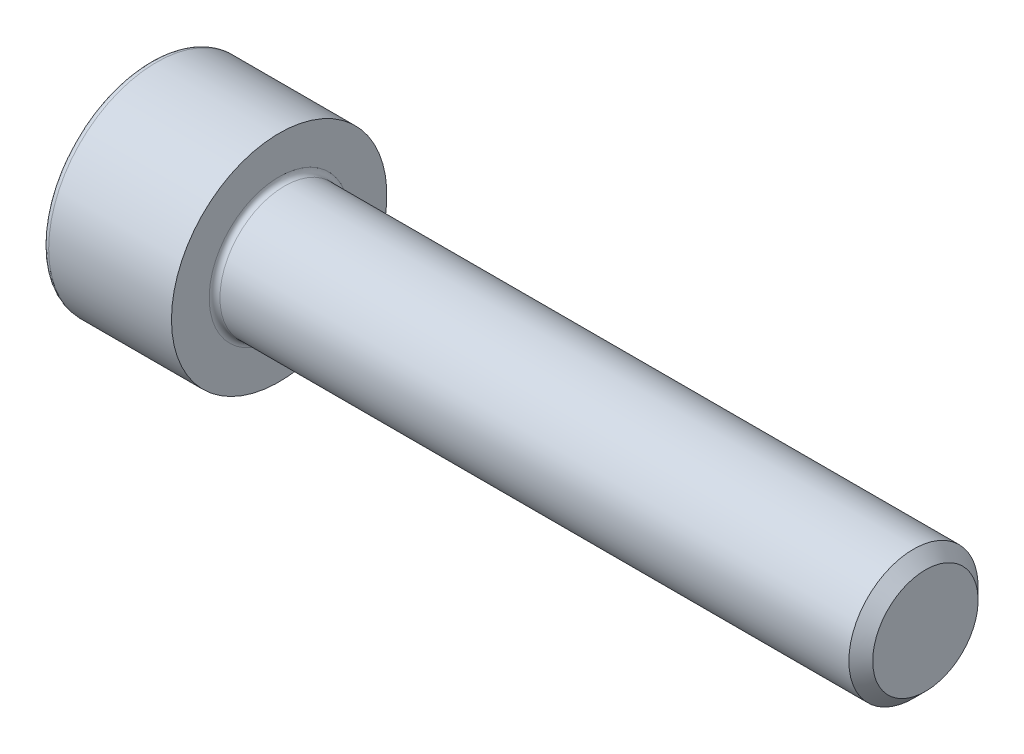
ISO-10303-21;
HEADER;
FILE_DESCRIPTION(('STEP AP214'),'2;1');
FILE_NAME('part.step','',(''),(''),'','','');
FILE_SCHEMA(('AUTOMOTIVE_DESIGN { 1 0 10303 214 1 1 1 1 }'));
ENDSEC;
DATA;
#1=APPLICATION_CONTEXT('core data for automotive mechanical design processes');
#2=APPLICATION_PROTOCOL_DEFINITION('international standard','automotive_design',2000,#1);
#3=PRODUCT_CONTEXT('',#1,'mechanical');
#4=PRODUCT('Part','Part','',(#3));
#5=PRODUCT_RELATED_PRODUCT_CATEGORY('part','',(#4));
#6=PRODUCT_DEFINITION_FORMATION('','',#4);
#7=PRODUCT_DEFINITION_CONTEXT('part definition',#1,'design');
#8=PRODUCT_DEFINITION('design','',#6,#7);
#9=PRODUCT_DEFINITION_SHAPE('','',#8);
#10=(LENGTH_UNIT() NAMED_UNIT(*) SI_UNIT(.MILLI.,.METRE.));
#11=(NAMED_UNIT(*) PLANE_ANGLE_UNIT() SI_UNIT($,.RADIAN.));
#12=(NAMED_UNIT(*) SI_UNIT($,.STERADIAN.) SOLID_ANGLE_UNIT());
#13=UNCERTAINTY_MEASURE_WITH_UNIT(LENGTH_MEASURE(1.E-05),#10,'distance_accuracy_value','');
#14=(GEOMETRIC_REPRESENTATION_CONTEXT(3) GLOBAL_UNCERTAINTY_ASSIGNED_CONTEXT((#13)) GLOBAL_UNIT_ASSIGNED_CONTEXT((#10,
#11,#12)) REPRESENTATION_CONTEXT('',''));
#15=CARTESIAN_POINT('',(0.,0.,0.));
#16=DIRECTION('',(0.,0.,1.));
#17=DIRECTION('',(1.,0.,0.));
#18=AXIS2_PLACEMENT_3D('',#15,#16,#17);
#19=CARTESIAN_POINT('',(0.,0.,0.));
#20=DIRECTION('',(-1.,0.,0.));
#21=DIRECTION('',(0.,0.,1.));
#22=AXIS2_PLACEMENT_3D('',#19,#20,#21);
#23=PLANE('',#22);
#24=DIRECTION('',(0.,-0.499999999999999,0.866025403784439));
#25=VECTOR('',#24,1.);
#26=CARTESIAN_POINT('',(0.,2.93524876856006,0.));
#27=LINE('',#26,#25);
#28=CARTESIAN_POINT('',(0.,2.93524876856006,0.));
#29=VERTEX_POINT('',#28);
#30=CARTESIAN_POINT('',(0.,1.46762438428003,2.542));
#31=VERTEX_POINT('',#30);
#32=EDGE_CURVE('E254',#29,#31,#27,.T.);
#33=ORIENTED_EDGE('',*,*,#32,.T.);
#34=DIRECTION('',(0.,1.,0.));
#35=VECTOR('',#34,1.);
#36=CARTESIAN_POINT('',(0.,-1.46762438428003,2.542));
#37=LINE('',#36,#35);
#38=CARTESIAN_POINT('',(0.,-1.46762438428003,2.542));
#39=VERTEX_POINT('',#38);
#40=EDGE_CURVE('E126',#39,#31,#37,.T.);
#41=ORIENTED_EDGE('',*,*,#40,.F.);
#42=DIRECTION('',(0.,-0.500000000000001,-0.866025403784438));
#43=VECTOR('',#42,1.);
#44=CARTESIAN_POINT('',(0.,-1.46762438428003,2.542));
#45=LINE('',#44,#43);
#46=CARTESIAN_POINT('',(0.,-2.93524876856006,0.));
#47=VERTEX_POINT('',#46);
#48=EDGE_CURVE('E257',#39,#47,#45,.T.);
#49=ORIENTED_EDGE('',*,*,#48,.T.);
#50=DIRECTION('',(0.,0.499999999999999,-0.866025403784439));
#51=VECTOR('',#50,1.);
#52=CARTESIAN_POINT('',(0.,-2.93524876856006,0.));
#53=LINE('',#52,#51);
#54=CARTESIAN_POINT('',(0.,-1.46762438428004,-2.542));
#55=VERTEX_POINT('',#54);
#56=EDGE_CURVE('E260',#47,#55,#53,.T.);
#57=ORIENTED_EDGE('',*,*,#56,.T.);
#58=DIRECTION('',(0.,-1.,0.));
#59=VECTOR('',#58,1.);
#60=CARTESIAN_POINT('',(0.,1.46762438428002,-2.54200000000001));
#61=LINE('',#60,#59);
#62=CARTESIAN_POINT('',(0.,1.46762438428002,-2.54200000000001));
#63=VERTEX_POINT('',#62);
#64=EDGE_CURVE('E263',#63,#55,#61,.T.);
#65=ORIENTED_EDGE('',*,*,#64,.F.);
#66=DIRECTION('',(0.,-0.500000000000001,-0.866025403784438));
#67=VECTOR('',#66,1.);
#68=CARTESIAN_POINT('',(0.,2.93524876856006,0.));
#69=LINE('',#68,#67);
#70=EDGE_CURVE('E121',#29,#63,#69,.T.);
#71=ORIENTED_EDGE('',*,*,#70,.F.);
#72=EDGE_LOOP('',(#33,#41,#49,#57,#65,#71));
#73=FACE_BOUND('',#72,.T.);
#74=CARTESIAN_POINT('',(0.,0.,0.));
#75=DIRECTION('',(-1.,0.,0.));
#76=DIRECTION('',(0.,0.,1.));
#77=AXIS2_PLACEMENT_3D('',#74,#75,#76);
#78=CIRCLE('',#77,4.7);
#79=CARTESIAN_POINT('',(0.,0.,4.7));
#80=VERTEX_POINT('',#79);
#81=EDGE_CURVE('E38',#80,#80,#78,.T.);
#82=ORIENTED_EDGE('',*,*,#81,.T.);
#83=EDGE_LOOP('',(#82));
#84=FACE_BOUND('',#83,.T.);
#85=ADVANCED_FACE('F30',(#73,#84),#23,.T.);
#86=CARTESIAN_POINT('',(-31.75,0.,0.));
#87=DIRECTION('',(-1.,0.,0.));
#88=DIRECTION('',(0.,0.,1.));
#89=AXIS2_PLACEMENT_3D('',#86,#87,#88);
#90=CYLINDRICAL_SURFACE('',#89,5.);
#91=CARTESIAN_POINT('',(0.300000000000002,0.,0.));
#92=DIRECTION('',(-1.,0.,0.));
#93=DIRECTION('',(0.,0.,1.));
#94=AXIS2_PLACEMENT_3D('',#91,#92,#93);
#95=CIRCLE('',#94,5.);
#96=CARTESIAN_POINT('',(0.300000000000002,0.,5.));
#97=VERTEX_POINT('',#96);
#98=EDGE_CURVE('E11',#97,#97,#95,.F.);
#99=ORIENTED_EDGE('',*,*,#98,.T.);
#100=EDGE_LOOP('',(#99));
#101=FACE_BOUND('',#100,.T.);
#102=CARTESIAN_POINT('',(6.,0.,0.));
#103=DIRECTION('',(-1.,0.,0.));
#104=DIRECTION('',(0.,0.,1.));
#105=AXIS2_PLACEMENT_3D('',#102,#103,#104);
#106=CIRCLE('',#105,5.);
#107=CARTESIAN_POINT('',(6.,0.,5.));
#108=VERTEX_POINT('',#107);
#109=EDGE_CURVE('E144',#108,#108,#106,.T.);
#110=ORIENTED_EDGE('',*,*,#109,.T.);
#111=EDGE_LOOP('',(#110));
#112=FACE_BOUND('',#111,.T.);
#113=ADVANCED_FACE('F168',(#101,#112),#90,.T.);
#114=CARTESIAN_POINT('',(6.,5.,0.));
#115=DIRECTION('',(1.,0.,0.));
#116=DIRECTION('',(0.,0.,-1.));
#117=AXIS2_PLACEMENT_3D('',#114,#115,#116);
#118=PLANE('',#117);
#119=CARTESIAN_POINT('',(6.,0.,0.));
#120=DIRECTION('',(1.,0.,0.));
#121=DIRECTION('',(0.,0.,-1.));
#122=AXIS2_PLACEMENT_3D('',#119,#120,#121);
#123=CIRCLE('',#122,3.25);
#124=CARTESIAN_POINT('',(6.,0.,-3.25));
#125=VERTEX_POINT('',#124);
#126=EDGE_CURVE('E147',#125,#125,#123,.F.);
#127=ORIENTED_EDGE('',*,*,#126,.T.);
#128=EDGE_LOOP('',(#127));
#129=FACE_BOUND('',#128,.T.);
#130=ORIENTED_EDGE('',*,*,#109,.F.);
#131=EDGE_LOOP('',(#130));
#132=FACE_BOUND('',#131,.T.);
#133=ADVANCED_FACE('F174',(#129,#132),#118,.T.);
#134=CARTESIAN_POINT('',(-31.75,0.,0.));
#135=DIRECTION('',(-1.,0.,0.));
#136=DIRECTION('',(0.,0.,1.));
#137=AXIS2_PLACEMENT_3D('',#134,#135,#136);
#138=CYLINDRICAL_SURFACE('',#137,3.);
#139=CARTESIAN_POINT('',(6.25,0.,0.));
#140=DIRECTION('',(1.,0.,0.));
#141=DIRECTION('',(0.,0.,-1.));
#142=AXIS2_PLACEMENT_3D('',#139,#140,#141);
#143=CIRCLE('',#142,3.);
#144=CARTESIAN_POINT('',(6.25,0.,-3.));
#145=VERTEX_POINT('',#144);
#146=EDGE_CURVE('E150',#145,#145,#143,.T.);
#147=ORIENTED_EDGE('',*,*,#146,.T.);
#148=EDGE_LOOP('',(#147));
#149=FACE_BOUND('',#148,.T.);
#150=CARTESIAN_POINT('',(35.4455,0.,0.));
#151=DIRECTION('',(-1.,0.,0.));
#152=DIRECTION('',(0.,0.,1.));
#153=AXIS2_PLACEMENT_3D('',#150,#151,#152);
#154=CIRCLE('',#153,3.);
#155=CARTESIAN_POINT('',(35.4455,0.,3.));
#156=VERTEX_POINT('',#155);
#157=EDGE_CURVE('E141',#156,#156,#154,.T.);
#158=ORIENTED_EDGE('',*,*,#157,.T.);
#159=EDGE_LOOP('',(#158));
#160=FACE_BOUND('',#159,.T.);
#161=ADVANCED_FACE('F180',(#149,#160),#138,.T.);
#162=CARTESIAN_POINT('',(36.,0.,0.));
#163=DIRECTION('',(-1.,0.,0.));
#164=DIRECTION('',(0.,0.,1.));
#165=AXIS2_PLACEMENT_3D('',#162,#163,#164);
#166=CONICAL_SURFACE('',#165,2.4455,0.78539816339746);
#167=ORIENTED_EDGE('',*,*,#157,.F.);
#168=EDGE_LOOP('',(#167));
#169=FACE_BOUND('',#168,.T.);
#170=CARTESIAN_POINT('',(36.,0.,0.));
#171=DIRECTION('',(-1.,0.,0.));
#172=DIRECTION('',(0.,0.,1.));
#173=AXIS2_PLACEMENT_3D('',#170,#171,#172);
#174=CIRCLE('',#173,2.4455);
#175=CARTESIAN_POINT('',(36.,0.,2.4455));
#176=VERTEX_POINT('',#175);
#177=EDGE_CURVE('E137',#176,#176,#174,.T.);
#178=ORIENTED_EDGE('',*,*,#177,.T.);
#179=EDGE_LOOP('',(#178));
#180=FACE_BOUND('',#179,.T.);
#181=ADVANCED_FACE('F184',(#169,#180),#166,.T.);
#182=CARTESIAN_POINT('',(36.,2.4455,0.));
#183=DIRECTION('',(1.,0.,0.));
#184=DIRECTION('',(0.,0.,-1.));
#185=AXIS2_PLACEMENT_3D('',#182,#183,#184);
#186=PLANE('',#185);
#187=ORIENTED_EDGE('',*,*,#177,.F.);
#188=EDGE_LOOP('',(#187));
#189=FACE_BOUND('',#188,.T.);
#190=ADVANCED_FACE('F164',(#189),#186,.T.);
#191=CARTESIAN_POINT('',(6.25,0.,0.));
#192=DIRECTION('',(1.,0.,0.));
#193=DIRECTION('',(0.,0.,-1.));
#194=AXIS2_PLACEMENT_3D('',#191,#192,#193);
#195=TOROIDAL_SURFACE('',#194,3.25,0.25);
#196=ORIENTED_EDGE('',*,*,#146,.F.);
#197=EDGE_LOOP('',(#196));
#198=FACE_BOUND('',#197,.T.);
#199=ORIENTED_EDGE('',*,*,#126,.F.);
#200=EDGE_LOOP('',(#199));
#201=FACE_BOUND('',#200,.T.);
#202=ADVANCED_FACE('F157',(#198,#201),#195,.F.);
#203=CARTESIAN_POINT('',(0.300000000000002,0.,0.));
#204=DIRECTION('',(-1.,0.,0.));
#205=DIRECTION('',(0.,0.,1.));
#206=AXIS2_PLACEMENT_3D('',#203,#204,#205);
#207=TOROIDAL_SURFACE('',#206,4.7,0.3);
#208=ORIENTED_EDGE('',*,*,#98,.F.);
#209=EDGE_LOOP('',(#208));
#210=FACE_BOUND('',#209,.T.);
#211=ORIENTED_EDGE('',*,*,#81,.F.);
#212=EDGE_LOOP('',(#211));
#213=FACE_BOUND('',#212,.T.);
#214=ADVANCED_FACE('F32',(#210,#213),#207,.T.);
#215=CARTESIAN_POINT('',(3.,2.93524876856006,0.));
#216=DIRECTION('',(0.,-0.866025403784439,-0.499999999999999));
#217=DIRECTION('',(0.,0.499999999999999,-0.866025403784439));
#218=AXIS2_PLACEMENT_3D('',#215,#216,#217);
#219=PLANE('',#218);
#220=ORIENTED_EDGE('',*,*,#32,.F.);
#221=DIRECTION('',(-1.,0.,0.));
#222=VECTOR('',#221,1.);
#223=CARTESIAN_POINT('',(3.,2.93524876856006,0.));
#224=LINE('',#223,#222);
#225=CARTESIAN_POINT('',(3.,2.93524876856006,0.));
#226=VERTEX_POINT('',#225);
#227=EDGE_CURVE('E244',#226,#29,#224,.T.);
#228=ORIENTED_EDGE('',*,*,#227,.F.);
#229=DIRECTION('',(0.,-0.499999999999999,0.866025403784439));
#230=VECTOR('',#229,1.);
#231=CARTESIAN_POINT('',(3.,2.93524876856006,0.));
#232=LINE('',#231,#230);
#233=CARTESIAN_POINT('',(3.,2.20143657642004,1.271));
#234=VERTEX_POINT('',#233);
#235=EDGE_CURVE('E113',#226,#234,#232,.T.);
#236=ORIENTED_EDGE('',*,*,#235,.T.);
#237=CARTESIAN_POINT('',(3.,1.46762438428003,2.542));
#238=VERTEX_POINT('',#237);
#239=EDGE_CURVE('E104',#234,#238,#232,.T.);
#240=ORIENTED_EDGE('',*,*,#239,.T.);
#241=DIRECTION('',(-1.,0.,0.));
#242=VECTOR('',#241,1.);
#243=CARTESIAN_POINT('',(3.,1.46762438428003,2.542));
#244=LINE('',#243,#242);
#245=EDGE_CURVE('E118',#238,#31,#244,.T.);
#246=ORIENTED_EDGE('',*,*,#245,.T.);
#247=EDGE_LOOP('',(#220,#228,#236,#240,#246));
#248=FACE_BOUND('',#247,.T.);
#249=ADVANCED_FACE('F117',(#248),#219,.T.);
#250=CARTESIAN_POINT('',(3.,-1.46762438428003,2.542));
#251=DIRECTION('',(0.,0.,1.));
#252=DIRECTION('',(0.,-1.,0.));
#253=AXIS2_PLACEMENT_3D('',#250,#251,#252);
#254=PLANE('',#253);
#255=ORIENTED_EDGE('',*,*,#40,.T.);
#256=ORIENTED_EDGE('',*,*,#245,.F.);
#257=DIRECTION('',(0.,1.,0.));
#258=VECTOR('',#257,1.);
#259=CARTESIAN_POINT('',(3.,-1.46762438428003,2.542));
#260=LINE('',#259,#258);
#261=CARTESIAN_POINT('',(3.,0.,2.542));
#262=VERTEX_POINT('',#261);
#263=EDGE_CURVE('E101',#262,#238,#260,.T.);
#264=ORIENTED_EDGE('',*,*,#263,.F.);
#265=CARTESIAN_POINT('',(3.,-1.46762438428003,2.542));
#266=VERTEX_POINT('',#265);
#267=EDGE_CURVE('E112',#266,#262,#260,.T.);
#268=ORIENTED_EDGE('',*,*,#267,.F.);
#269=DIRECTION('',(-1.,0.,0.));
#270=VECTOR('',#269,1.);
#271=CARTESIAN_POINT('',(3.,-1.46762438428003,2.542));
#272=LINE('',#271,#270);
#273=EDGE_CURVE('E128',#266,#39,#272,.T.);
#274=ORIENTED_EDGE('',*,*,#273,.T.);
#275=EDGE_LOOP('',(#255,#256,#264,#268,#274));
#276=FACE_BOUND('',#275,.T.);
#277=ADVANCED_FACE('F123',(#276),#254,.F.);
#278=CARTESIAN_POINT('',(3.,-1.46762438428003,2.542));
#279=DIRECTION('',(0.,0.866025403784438,-0.500000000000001));
#280=DIRECTION('',(0.,0.500000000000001,0.866025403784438));
#281=AXIS2_PLACEMENT_3D('',#278,#279,#280);
#282=PLANE('',#281);
#283=ORIENTED_EDGE('',*,*,#48,.F.);
#284=ORIENTED_EDGE('',*,*,#273,.F.);
#285=DIRECTION('',(0.,-0.500000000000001,-0.866025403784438));
#286=VECTOR('',#285,1.);
#287=CARTESIAN_POINT('',(3.,-1.46762438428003,2.542));
#288=LINE('',#287,#286);
#289=CARTESIAN_POINT('',(3.,-2.20143657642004,1.271));
#290=VERTEX_POINT('',#289);
#291=EDGE_CURVE('E283',#266,#290,#288,.T.);
#292=ORIENTED_EDGE('',*,*,#291,.T.);
#293=CARTESIAN_POINT('',(3.,-2.93524876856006,0.));
#294=VERTEX_POINT('',#293);
#295=EDGE_CURVE('E272',#290,#294,#288,.T.);
#296=ORIENTED_EDGE('',*,*,#295,.T.);
#297=DIRECTION('',(-1.,0.,0.));
#298=VECTOR('',#297,1.);
#299=CARTESIAN_POINT('',(3.,-2.93524876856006,0.));
#300=LINE('',#299,#298);
#301=EDGE_CURVE('E133',#294,#47,#300,.T.);
#302=ORIENTED_EDGE('',*,*,#301,.T.);
#303=EDGE_LOOP('',(#283,#284,#292,#296,#302));
#304=FACE_BOUND('',#303,.T.);
#305=ADVANCED_FACE('F198',(#304),#282,.T.);
#306=CARTESIAN_POINT('',(3.,-2.93524876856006,0.));
#307=DIRECTION('',(0.,0.866025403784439,0.499999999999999));
#308=DIRECTION('',(0.,-0.499999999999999,0.866025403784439));
#309=AXIS2_PLACEMENT_3D('',#306,#307,#308);
#310=PLANE('',#309);
#311=ORIENTED_EDGE('',*,*,#56,.F.);
#312=ORIENTED_EDGE('',*,*,#301,.F.);
#313=DIRECTION('',(0.,0.499999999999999,-0.866025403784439));
#314=VECTOR('',#313,1.);
#315=CARTESIAN_POINT('',(3.,-2.93524876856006,0.));
#316=LINE('',#315,#314);
#317=CARTESIAN_POINT('',(3.,-2.20143657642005,-1.271));
#318=VERTEX_POINT('',#317);
#319=EDGE_CURVE('E250',#294,#318,#316,.T.);
#320=ORIENTED_EDGE('',*,*,#319,.T.);
#321=CARTESIAN_POINT('',(3.,-1.46762438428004,-2.542));
#322=VERTEX_POINT('',#321);
#323=EDGE_CURVE('E282',#318,#322,#316,.T.);
#324=ORIENTED_EDGE('',*,*,#323,.T.);
#325=DIRECTION('',(-1.,0.,0.));
#326=VECTOR('',#325,1.);
#327=CARTESIAN_POINT('',(3.,-1.46762438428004,-2.542));
#328=LINE('',#327,#326);
#329=EDGE_CURVE('E243',#322,#55,#328,.T.);
#330=ORIENTED_EDGE('',*,*,#329,.T.);
#331=EDGE_LOOP('',(#311,#312,#320,#324,#330));
#332=FACE_BOUND('',#331,.T.);
#333=ADVANCED_FACE('F201',(#332),#310,.T.);
#334=CARTESIAN_POINT('',(3.,1.46762438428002,-2.54200000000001));
#335=DIRECTION('',(0.,0.,-1.));
#336=DIRECTION('',(0.,1.,0.));
#337=AXIS2_PLACEMENT_3D('',#334,#335,#336);
#338=PLANE('',#337);
#339=ORIENTED_EDGE('',*,*,#64,.T.);
#340=ORIENTED_EDGE('',*,*,#329,.F.);
#341=DIRECTION('',(0.,-1.,0.));
#342=VECTOR('',#341,1.);
#343=CARTESIAN_POINT('',(3.,1.46762438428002,-2.54200000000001));
#344=LINE('',#343,#342);
#345=CARTESIAN_POINT('',(3.,0.,-2.542));
#346=VERTEX_POINT('',#345);
#347=EDGE_CURVE('E247',#346,#322,#344,.T.);
#348=ORIENTED_EDGE('',*,*,#347,.F.);
#349=CARTESIAN_POINT('',(3.,1.46762438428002,-2.54200000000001));
#350=VERTEX_POINT('',#349);
#351=EDGE_CURVE('E45',#350,#346,#344,.T.);
#352=ORIENTED_EDGE('',*,*,#351,.F.);
#353=DIRECTION('',(-1.,0.,0.));
#354=VECTOR('',#353,1.);
#355=CARTESIAN_POINT('',(3.,1.46762438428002,-2.54200000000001));
#356=LINE('',#355,#354);
#357=EDGE_CURVE('E240',#350,#63,#356,.T.);
#358=ORIENTED_EDGE('',*,*,#357,.T.);
#359=EDGE_LOOP('',(#339,#340,#348,#352,#358));
#360=FACE_BOUND('',#359,.T.);
#361=ADVANCED_FACE('F205',(#360),#338,.F.);
#362=CARTESIAN_POINT('',(3.,2.93524876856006,0.));
#363=DIRECTION('',(0.,0.866025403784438,-0.500000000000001));
#364=DIRECTION('',(0.,0.500000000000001,0.866025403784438));
#365=AXIS2_PLACEMENT_3D('',#362,#363,#364);
#366=PLANE('',#365);
#367=ORIENTED_EDGE('',*,*,#70,.T.);
#368=ORIENTED_EDGE('',*,*,#357,.F.);
#369=DIRECTION('',(0.,-0.500000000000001,-0.866025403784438));
#370=VECTOR('',#369,1.);
#371=CARTESIAN_POINT('',(3.,2.93524876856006,0.));
#372=LINE('',#371,#370);
#373=CARTESIAN_POINT('',(3.,2.20143657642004,-1.271));
#374=VERTEX_POINT('',#373);
#375=EDGE_CURVE('E230',#374,#350,#372,.T.);
#376=ORIENTED_EDGE('',*,*,#375,.F.);
#377=EDGE_CURVE('E236',#226,#374,#372,.T.);
#378=ORIENTED_EDGE('',*,*,#377,.F.);
#379=ORIENTED_EDGE('',*,*,#227,.T.);
#380=EDGE_LOOP('',(#367,#368,#376,#378,#379));
#381=FACE_BOUND('',#380,.T.);
#382=ADVANCED_FACE('F209',(#381),#366,.F.);
#383=CARTESIAN_POINT('',(3.,2.93524876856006,0.));
#384=DIRECTION('',(1.,0.,0.));
#385=DIRECTION('',(0.,0.,-1.));
#386=AXIS2_PLACEMENT_3D('',#383,#384,#385);
#387=PLANE('',#386);
#388=ORIENTED_EDGE('',*,*,#347,.T.);
#389=ORIENTED_EDGE('',*,*,#323,.F.);
#390=CARTESIAN_POINT('',(3.,0.,0.));
#391=DIRECTION('',(-1.,0.,0.));
#392=DIRECTION('',(0.,0.,1.));
#393=AXIS2_PLACEMENT_3D('',#390,#391,#392);
#394=CIRCLE('',#393,2.542);
#395=EDGE_CURVE('E278',#346,#318,#394,.T.);
#396=ORIENTED_EDGE('',*,*,#395,.F.);
#397=EDGE_LOOP('',(#388,#389,#396));
#398=FACE_BOUND('',#397,.T.);
#399=ADVANCED_FACE('F213',(#398),#387,.F.);
#400=ORIENTED_EDGE('',*,*,#319,.F.);
#401=ORIENTED_EDGE('',*,*,#295,.F.);
#402=EDGE_CURVE('E131',#318,#290,#394,.T.);
#403=ORIENTED_EDGE('',*,*,#402,.F.);
#404=EDGE_LOOP('',(#400,#401,#403));
#405=FACE_BOUND('',#404,.T.);
#406=ADVANCED_FACE('F216',(#405),#387,.F.);
#407=ORIENTED_EDGE('',*,*,#291,.F.);
#408=ORIENTED_EDGE('',*,*,#267,.T.);
#409=EDGE_CURVE('E127',#290,#262,#394,.T.);
#410=ORIENTED_EDGE('',*,*,#409,.F.);
#411=EDGE_LOOP('',(#407,#408,#410));
#412=FACE_BOUND('',#411,.T.);
#413=ADVANCED_FACE('F221',(#412),#387,.F.);
#414=ORIENTED_EDGE('',*,*,#263,.T.);
#415=ORIENTED_EDGE('',*,*,#239,.F.);
#416=EDGE_CURVE('E107',#262,#234,#394,.T.);
#417=ORIENTED_EDGE('',*,*,#416,.F.);
#418=EDGE_LOOP('',(#414,#415,#417));
#419=FACE_BOUND('',#418,.T.);
#420=ADVANCED_FACE('F103',(#419),#387,.F.);
#421=ORIENTED_EDGE('',*,*,#235,.F.);
#422=ORIENTED_EDGE('',*,*,#377,.T.);
#423=EDGE_CURVE('E138',#234,#374,#394,.T.);
#424=ORIENTED_EDGE('',*,*,#423,.F.);
#425=EDGE_LOOP('',(#421,#422,#424));
#426=FACE_BOUND('',#425,.T.);
#427=ADVANCED_FACE('F224',(#426),#387,.F.);
#428=ORIENTED_EDGE('',*,*,#375,.T.);
#429=ORIENTED_EDGE('',*,*,#351,.T.);
#430=EDGE_CURVE('E233',#374,#346,#394,.T.);
#431=ORIENTED_EDGE('',*,*,#430,.F.);
#432=EDGE_LOOP('',(#428,#429,#431));
#433=FACE_BOUND('',#432,.T.);
#434=ADVANCED_FACE('F194',(#433),#387,.F.);
#435=CARTESIAN_POINT('',(3.,0.,0.));
#436=DIRECTION('',(-1.,0.,0.));
#437=DIRECTION('',(0.,0.,1.));
#438=AXIS2_PLACEMENT_3D('',#435,#436,#437);
#439=CONICAL_SURFACE('',#438,2.542,1.04719755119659);
#440=CARTESIAN_POINT('',(4.46762438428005,0.,0.));
#441=VERTEX_POINT('',#440);
#442=VERTEX_LOOP('',#441);
#443=FACE_BOUND('',#442,.T.);
#444=ORIENTED_EDGE('',*,*,#416,.T.);
#445=ORIENTED_EDGE('',*,*,#423,.T.);
#446=ORIENTED_EDGE('',*,*,#430,.T.);
#447=ORIENTED_EDGE('',*,*,#395,.T.);
#448=ORIENTED_EDGE('',*,*,#402,.T.);
#449=ORIENTED_EDGE('',*,*,#409,.T.);
#450=EDGE_LOOP('',(#444,#445,#446,#447,#448,#449));
#451=FACE_BOUND('',#450,.T.);
#452=ADVANCED_FACE('F192',(#443,#451),#439,.F.);
#453=CLOSED_SHELL('',(#85,#113,#133,#161,#181,#190,#202,#214,#249,#277,#305,#333,#361,#382,#399,
#406,#413,#420,#427,#434,#452));
#454=MANIFOLD_SOLID_BREP('B2',#453);
#455=ADVANCED_BREP_SHAPE_REPRESENTATION('',(#18,#454),#14);
#456=SHAPE_DEFINITION_REPRESENTATION(#9,#455);
ENDSEC;
END-ISO-10303-21;
